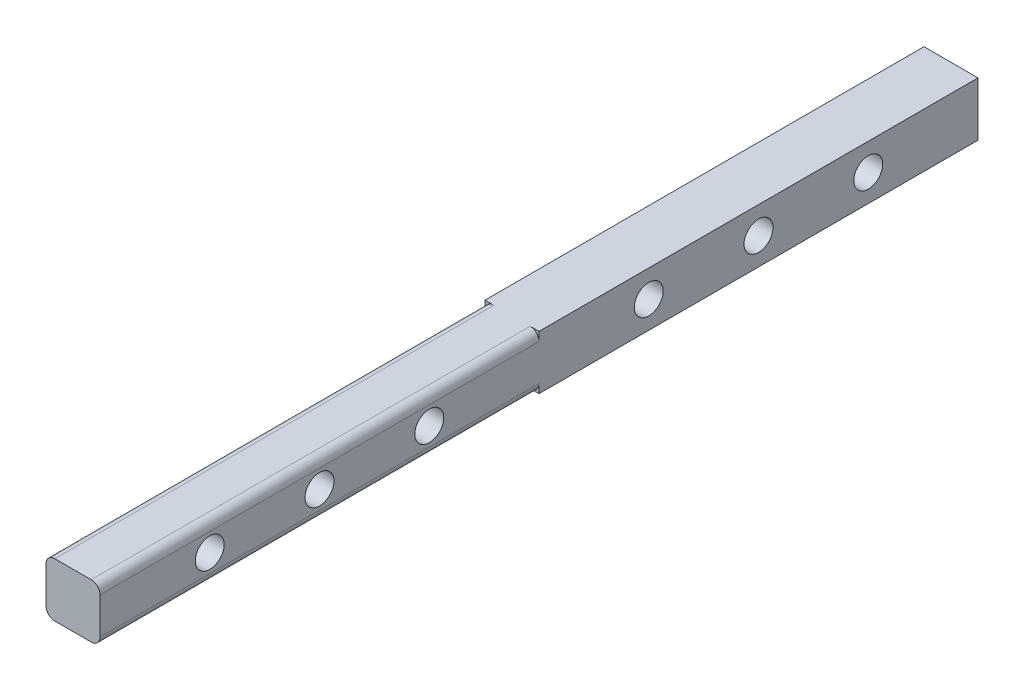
ISO-10303-21;
HEADER;
FILE_DESCRIPTION(('STEP AP214'),'2;1');
FILE_NAME('part.step','',(''),(''),'','','');
FILE_SCHEMA(('AUTOMOTIVE_DESIGN { 1 0 10303 214 1 1 1 1 }'));
ENDSEC;
DATA;
#1=APPLICATION_CONTEXT('core data for automotive mechanical design processes');
#2=APPLICATION_PROTOCOL_DEFINITION('international standard','automotive_design',2000,#1);
#3=PRODUCT_CONTEXT('',#1,'mechanical');
#4=PRODUCT('Part','Part','',(#3));
#5=PRODUCT_RELATED_PRODUCT_CATEGORY('part','',(#4));
#6=PRODUCT_DEFINITION_FORMATION('','',#4);
#7=PRODUCT_DEFINITION_CONTEXT('part definition',#1,'design');
#8=PRODUCT_DEFINITION('design','',#6,#7);
#9=PRODUCT_DEFINITION_SHAPE('','',#8);
#10=(LENGTH_UNIT() NAMED_UNIT(*) SI_UNIT(.MILLI.,.METRE.));
#11=(NAMED_UNIT(*) PLANE_ANGLE_UNIT() SI_UNIT($,.RADIAN.));
#12=(NAMED_UNIT(*) SI_UNIT($,.STERADIAN.) SOLID_ANGLE_UNIT());
#13=UNCERTAINTY_MEASURE_WITH_UNIT(LENGTH_MEASURE(1.E-05),#10,'distance_accuracy_value','');
#14=(GEOMETRIC_REPRESENTATION_CONTEXT(3) GLOBAL_UNCERTAINTY_ASSIGNED_CONTEXT((#13)) GLOBAL_UNIT_ASSIGNED_CONTEXT((#10,
#11,#12)) REPRESENTATION_CONTEXT('',''));
#15=CARTESIAN_POINT('',(0.,0.,0.));
#16=DIRECTION('',(0.,0.,1.));
#17=DIRECTION('',(1.,0.,0.));
#18=AXIS2_PLACEMENT_3D('',#15,#16,#17);
#19=CARTESIAN_POINT('',(3.075,3.075,50.));
#20=DIRECTION('',(-1.,0.,0.));
#21=DIRECTION('',(0.,0.,1.));
#22=AXIS2_PLACEMENT_3D('',#19,#20,#21);
#23=PLANE('',#22);
#24=CARTESIAN_POINT('',(3.075,0.,37.5));
#25=DIRECTION('',(1.,0.,0.));
#26=DIRECTION('',(0.,0.,-1.));
#27=AXIS2_PLACEMENT_3D('',#24,#25,#26);
#28=CIRCLE('',#27,1.65);
#29=CARTESIAN_POINT('',(3.075,0.,35.85));
#30=VERTEX_POINT('',#29);
#31=EDGE_CURVE('E229',#30,#30,#28,.T.);
#32=ORIENTED_EDGE('',*,*,#31,.F.);
#33=EDGE_LOOP('',(#32));
#34=FACE_BOUND('',#33,.T.);
#35=CARTESIAN_POINT('',(3.075,0.,25.));
#36=DIRECTION('',(1.,0.,0.));
#37=DIRECTION('',(0.,0.,-1.));
#38=AXIS2_PLACEMENT_3D('',#35,#36,#37);
#39=CIRCLE('',#38,1.65);
#40=CARTESIAN_POINT('',(3.075,0.,23.35));
#41=VERTEX_POINT('',#40);
#42=EDGE_CURVE('E239',#41,#41,#39,.T.);
#43=ORIENTED_EDGE('',*,*,#42,.F.);
#44=EDGE_LOOP('',(#43));
#45=FACE_BOUND('',#44,.T.);
#46=CARTESIAN_POINT('',(3.075,0.,12.5));
#47=DIRECTION('',(1.,0.,0.));
#48=DIRECTION('',(0.,0.,-1.));
#49=AXIS2_PLACEMENT_3D('',#46,#47,#48);
#50=CIRCLE('',#49,1.65);
#51=CARTESIAN_POINT('',(3.075,0.,10.85));
#52=VERTEX_POINT('',#51);
#53=EDGE_CURVE('E245',#52,#52,#50,.T.);
#54=ORIENTED_EDGE('',*,*,#53,.F.);
#55=EDGE_LOOP('',(#54));
#56=FACE_BOUND('',#55,.T.);
#57=CARTESIAN_POINT('',(3.075,0.,-12.5));
#58=DIRECTION('',(1.,0.,0.));
#59=DIRECTION('',(0.,0.,-1.));
#60=AXIS2_PLACEMENT_3D('',#57,#58,#59);
#61=CIRCLE('',#60,1.65);
#62=CARTESIAN_POINT('',(3.075,0.,-14.15));
#63=VERTEX_POINT('',#62);
#64=EDGE_CURVE('E251',#63,#63,#61,.T.);
#65=ORIENTED_EDGE('',*,*,#64,.F.);
#66=EDGE_LOOP('',(#65));
#67=FACE_BOUND('',#66,.T.);
#68=CARTESIAN_POINT('',(3.075,0.,-25.));
#69=DIRECTION('',(1.,0.,0.));
#70=DIRECTION('',(0.,0.,-1.));
#71=AXIS2_PLACEMENT_3D('',#68,#69,#70);
#72=CIRCLE('',#71,1.65);
#73=CARTESIAN_POINT('',(3.075,0.,-26.65));
#74=VERTEX_POINT('',#73);
#75=EDGE_CURVE('E257',#74,#74,#72,.T.);
#76=ORIENTED_EDGE('',*,*,#75,.F.);
#77=EDGE_LOOP('',(#76));
#78=FACE_BOUND('',#77,.T.);
#79=CARTESIAN_POINT('',(3.075,0.,-37.5));
#80=DIRECTION('',(1.,0.,0.));
#81=DIRECTION('',(0.,0.,-1.));
#82=AXIS2_PLACEMENT_3D('',#79,#80,#81);
#83=CIRCLE('',#82,1.65);
#84=CARTESIAN_POINT('',(3.075,0.,-39.15));
#85=VERTEX_POINT('',#84);
#86=EDGE_CURVE('E159',#85,#85,#83,.T.);
#87=ORIENTED_EDGE('',*,*,#86,.F.);
#88=EDGE_LOOP('',(#87));
#89=FACE_BOUND('',#88,.T.);
#90=DIRECTION('',(0.,1.,0.));
#91=VECTOR('',#90,1.);
#92=CARTESIAN_POINT('',(3.075,3.075,50.));
#93=LINE('',#92,#91);
#94=CARTESIAN_POINT('',(3.075,-2.075,50.));
#95=VERTEX_POINT('',#94);
#96=CARTESIAN_POINT('',(3.075,2.075,50.));
#97=VERTEX_POINT('',#96);
#98=EDGE_CURVE('E175',#95,#97,#93,.T.);
#99=ORIENTED_EDGE('',*,*,#98,.F.);
#100=DIRECTION('',(0.,0.,-1.));
#101=VECTOR('',#100,1.);
#102=CARTESIAN_POINT('',(3.075,-2.075,50.));
#103=LINE('',#102,#101);
#104=CARTESIAN_POINT('',(3.075,-2.075,0.));
#105=VERTEX_POINT('',#104);
#106=EDGE_CURVE('E191',#95,#105,#103,.T.);
#107=ORIENTED_EDGE('',*,*,#106,.T.);
#108=DIRECTION('',(0.,1.,0.));
#109=VECTOR('',#108,1.);
#110=CARTESIAN_POINT('',(3.075,3.075,0.));
#111=LINE('',#110,#109);
#112=CARTESIAN_POINT('',(3.075,-3.075,0.));
#113=VERTEX_POINT('',#112);
#114=EDGE_CURVE('E164',#113,#105,#111,.T.);
#115=ORIENTED_EDGE('',*,*,#114,.F.);
#116=DIRECTION('',(0.,0.,1.));
#117=VECTOR('',#116,1.);
#118=CARTESIAN_POINT('',(3.075,-3.075,-50.));
#119=LINE('',#118,#117);
#120=CARTESIAN_POINT('',(3.075,-3.075,-50.));
#121=VERTEX_POINT('',#120);
#122=EDGE_CURVE('E152',#121,#113,#119,.T.);
#123=ORIENTED_EDGE('',*,*,#122,.F.);
#124=DIRECTION('',(0.,1.,0.));
#125=VECTOR('',#124,1.);
#126=CARTESIAN_POINT('',(3.075,3.075,-50.));
#127=LINE('',#126,#125);
#128=CARTESIAN_POINT('',(3.075,3.075,-50.));
#129=VERTEX_POINT('',#128);
#130=EDGE_CURVE('E144',#121,#129,#127,.T.);
#131=ORIENTED_EDGE('',*,*,#130,.T.);
#132=DIRECTION('',(0.,0.,1.));
#133=VECTOR('',#132,1.);
#134=CARTESIAN_POINT('',(3.075,3.075,-50.));
#135=LINE('',#134,#133);
#136=CARTESIAN_POINT('',(3.075,3.075,0.));
#137=VERTEX_POINT('',#136);
#138=EDGE_CURVE('E125',#129,#137,#135,.T.);
#139=ORIENTED_EDGE('',*,*,#138,.T.);
#140=CARTESIAN_POINT('',(3.075,2.075,0.));
#141=VERTEX_POINT('',#140);
#142=EDGE_CURVE('E168',#141,#137,#111,.T.);
#143=ORIENTED_EDGE('',*,*,#142,.F.);
#144=DIRECTION('',(0.,0.,-1.));
#145=VECTOR('',#144,1.);
#146=CARTESIAN_POINT('',(3.075,2.075,50.));
#147=LINE('',#146,#145);
#148=EDGE_CURVE('E189',#141,#97,#147,.F.);
#149=ORIENTED_EDGE('',*,*,#148,.T.);
#150=EDGE_LOOP('',(#99,#107,#115,#123,#131,#139,#143,#149));
#151=FACE_BOUND('',#150,.T.);
#152=ADVANCED_FACE('F35',(#34,#45,#56,#67,#78,#89,#151),#23,.F.);
#153=CARTESIAN_POINT('',(-3.075,3.075,50.));
#154=DIRECTION('',(0.,-1.,0.));
#155=DIRECTION('',(0.,0.,-1.));
#156=AXIS2_PLACEMENT_3D('',#153,#154,#155);
#157=PLANE('',#156);
#158=DIRECTION('',(0.,0.,-1.));
#159=VECTOR('',#158,1.);
#160=CARTESIAN_POINT('',(2.075,3.075,50.));
#161=LINE('',#160,#159);
#162=CARTESIAN_POINT('',(2.075,3.075,50.));
#163=VERTEX_POINT('',#162);
#164=CARTESIAN_POINT('',(2.075,3.075,0.));
#165=VERTEX_POINT('',#164);
#166=EDGE_CURVE('E43',#163,#165,#161,.T.);
#167=ORIENTED_EDGE('',*,*,#166,.T.);
#168=DIRECTION('',(-1.,0.,0.));
#169=VECTOR('',#168,1.);
#170=CARTESIAN_POINT('',(-3.075,3.075,0.));
#171=LINE('',#170,#169);
#172=EDGE_CURVE('E132',#137,#165,#171,.T.);
#173=ORIENTED_EDGE('',*,*,#172,.F.);
#174=ORIENTED_EDGE('',*,*,#138,.F.);
#175=DIRECTION('',(-1.,0.,0.));
#176=VECTOR('',#175,1.);
#177=CARTESIAN_POINT('',(-3.075,3.075,-50.));
#178=LINE('',#177,#176);
#179=CARTESIAN_POINT('',(-3.075,3.075,-50.));
#180=VERTEX_POINT('',#179);
#181=EDGE_CURVE('E130',#129,#180,#178,.T.);
#182=ORIENTED_EDGE('',*,*,#181,.T.);
#183=DIRECTION('',(0.,0.,1.));
#184=VECTOR('',#183,1.);
#185=CARTESIAN_POINT('',(-3.075,3.075,-50.));
#186=LINE('',#185,#184);
#187=CARTESIAN_POINT('',(-3.075,3.075,0.));
#188=VERTEX_POINT('',#187);
#189=EDGE_CURVE('E136',#180,#188,#186,.T.);
#190=ORIENTED_EDGE('',*,*,#189,.T.);
#191=CARTESIAN_POINT('',(-2.075,3.075,0.));
#192=VERTEX_POINT('',#191);
#193=EDGE_CURVE('E167',#192,#188,#171,.T.);
#194=ORIENTED_EDGE('',*,*,#193,.F.);
#195=DIRECTION('',(0.,0.,-1.));
#196=VECTOR('',#195,1.);
#197=CARTESIAN_POINT('',(-2.075,3.075,50.));
#198=LINE('',#197,#196);
#199=CARTESIAN_POINT('',(-2.075,3.075,50.));
#200=VERTEX_POINT('',#199);
#201=EDGE_CURVE('E11',#192,#200,#198,.F.);
#202=ORIENTED_EDGE('',*,*,#201,.T.);
#203=DIRECTION('',(-1.,0.,0.));
#204=VECTOR('',#203,1.);
#205=CARTESIAN_POINT('',(-3.075,3.075,50.));
#206=LINE('',#205,#204);
#207=EDGE_CURVE('E182',#163,#200,#206,.T.);
#208=ORIENTED_EDGE('',*,*,#207,.F.);
#209=EDGE_LOOP('',(#167,#173,#174,#182,#190,#194,#202,#208));
#210=FACE_BOUND('',#209,.T.);
#211=ADVANCED_FACE('F128',(#210),#157,.F.);
#212=CARTESIAN_POINT('',(-3.075,3.075,50.));
#213=DIRECTION('',(1.,0.,0.));
#214=DIRECTION('',(0.,0.,-1.));
#215=AXIS2_PLACEMENT_3D('',#212,#213,#214);
#216=PLANE('',#215);
#217=CARTESIAN_POINT('',(-3.075,0.,37.5));
#218=DIRECTION('',(1.,0.,0.));
#219=DIRECTION('',(0.,0.,-1.));
#220=AXIS2_PLACEMENT_3D('',#217,#218,#219);
#221=CIRCLE('',#220,1.65);
#222=CARTESIAN_POINT('',(-3.075,0.,35.85));
#223=VERTEX_POINT('',#222);
#224=EDGE_CURVE('E227',#223,#223,#221,.T.);
#225=ORIENTED_EDGE('',*,*,#224,.T.);
#226=EDGE_LOOP('',(#225));
#227=FACE_BOUND('',#226,.T.);
#228=CARTESIAN_POINT('',(-3.075,0.,25.));
#229=DIRECTION('',(1.,0.,0.));
#230=DIRECTION('',(0.,0.,-1.));
#231=AXIS2_PLACEMENT_3D('',#228,#229,#230);
#232=CIRCLE('',#231,1.65);
#233=CARTESIAN_POINT('',(-3.075,0.,23.35));
#234=VERTEX_POINT('',#233);
#235=EDGE_CURVE('E234',#234,#234,#232,.T.);
#236=ORIENTED_EDGE('',*,*,#235,.T.);
#237=EDGE_LOOP('',(#236));
#238=FACE_BOUND('',#237,.T.);
#239=CARTESIAN_POINT('',(-3.075,0.,12.5));
#240=DIRECTION('',(1.,0.,0.));
#241=DIRECTION('',(0.,0.,-1.));
#242=AXIS2_PLACEMENT_3D('',#239,#240,#241);
#243=CIRCLE('',#242,1.65);
#244=CARTESIAN_POINT('',(-3.075,0.,10.85));
#245=VERTEX_POINT('',#244);
#246=EDGE_CURVE('E242',#245,#245,#243,.T.);
#247=ORIENTED_EDGE('',*,*,#246,.T.);
#248=EDGE_LOOP('',(#247));
#249=FACE_BOUND('',#248,.T.);
#250=CARTESIAN_POINT('',(-3.075,0.,-12.5));
#251=DIRECTION('',(1.,0.,0.));
#252=DIRECTION('',(0.,0.,-1.));
#253=AXIS2_PLACEMENT_3D('',#250,#251,#252);
#254=CIRCLE('',#253,1.65);
#255=CARTESIAN_POINT('',(-3.075,0.,-14.15));
#256=VERTEX_POINT('',#255);
#257=EDGE_CURVE('E248',#256,#256,#254,.T.);
#258=ORIENTED_EDGE('',*,*,#257,.T.);
#259=EDGE_LOOP('',(#258));
#260=FACE_BOUND('',#259,.T.);
#261=CARTESIAN_POINT('',(-3.075,0.,-25.));
#262=DIRECTION('',(1.,0.,0.));
#263=DIRECTION('',(0.,0.,-1.));
#264=AXIS2_PLACEMENT_3D('',#261,#262,#263);
#265=CIRCLE('',#264,1.65);
#266=CARTESIAN_POINT('',(-3.075,0.,-26.65));
#267=VERTEX_POINT('',#266);
#268=EDGE_CURVE('E254',#267,#267,#265,.T.);
#269=ORIENTED_EDGE('',*,*,#268,.T.);
#270=EDGE_LOOP('',(#269));
#271=FACE_BOUND('',#270,.T.);
#272=CARTESIAN_POINT('',(-3.075,0.,-37.5));
#273=DIRECTION('',(1.,0.,0.));
#274=DIRECTION('',(0.,0.,-1.));
#275=AXIS2_PLACEMENT_3D('',#272,#273,#274);
#276=CIRCLE('',#275,1.65);
#277=CARTESIAN_POINT('',(-3.075,0.,-39.15));
#278=VERTEX_POINT('',#277);
#279=EDGE_CURVE('E259',#278,#278,#276,.T.);
#280=ORIENTED_EDGE('',*,*,#279,.T.);
#281=EDGE_LOOP('',(#280));
#282=FACE_BOUND('',#281,.T.);
#283=DIRECTION('',(0.,0.,-1.));
#284=VECTOR('',#283,1.);
#285=CARTESIAN_POINT('',(-3.075,2.075,50.));
#286=LINE('',#285,#284);
#287=CARTESIAN_POINT('',(-3.075,2.075,50.));
#288=VERTEX_POINT('',#287);
#289=CARTESIAN_POINT('',(-3.075,2.075,0.));
#290=VERTEX_POINT('',#289);
#291=EDGE_CURVE('E218',#288,#290,#286,.T.);
#292=ORIENTED_EDGE('',*,*,#291,.T.);
#293=DIRECTION('',(0.,-1.,0.));
#294=VECTOR('',#293,1.);
#295=CARTESIAN_POINT('',(-3.075,3.075,0.));
#296=LINE('',#295,#294);
#297=EDGE_CURVE('E171',#188,#290,#296,.T.);
#298=ORIENTED_EDGE('',*,*,#297,.F.);
#299=ORIENTED_EDGE('',*,*,#189,.F.);
#300=DIRECTION('',(0.,-1.,0.));
#301=VECTOR('',#300,1.);
#302=CARTESIAN_POINT('',(-3.075,3.075,-50.));
#303=LINE('',#302,#301);
#304=CARTESIAN_POINT('',(-3.075,-3.075,-50.));
#305=VERTEX_POINT('',#304);
#306=EDGE_CURVE('E147',#180,#305,#303,.T.);
#307=ORIENTED_EDGE('',*,*,#306,.T.);
#308=DIRECTION('',(0.,0.,1.));
#309=VECTOR('',#308,1.);
#310=CARTESIAN_POINT('',(-3.075,-3.075,-50.));
#311=LINE('',#310,#309);
#312=CARTESIAN_POINT('',(-3.075,-3.075,0.));
#313=VERTEX_POINT('',#312);
#314=EDGE_CURVE('E176',#305,#313,#311,.T.);
#315=ORIENTED_EDGE('',*,*,#314,.T.);
#316=CARTESIAN_POINT('',(-3.075,-2.075,0.));
#317=VERTEX_POINT('',#316);
#318=EDGE_CURVE('E170',#317,#313,#296,.T.);
#319=ORIENTED_EDGE('',*,*,#318,.F.);
#320=DIRECTION('',(0.,0.,-1.));
#321=VECTOR('',#320,1.);
#322=CARTESIAN_POINT('',(-3.075,-2.075,50.));
#323=LINE('',#322,#321);
#324=CARTESIAN_POINT('',(-3.075,-2.075,50.));
#325=VERTEX_POINT('',#324);
#326=EDGE_CURVE('E50',#317,#325,#323,.F.);
#327=ORIENTED_EDGE('',*,*,#326,.T.);
#328=DIRECTION('',(0.,-1.,0.));
#329=VECTOR('',#328,1.);
#330=CARTESIAN_POINT('',(-3.075,3.075,50.));
#331=LINE('',#330,#329);
#332=EDGE_CURVE('E184',#288,#325,#331,.T.);
#333=ORIENTED_EDGE('',*,*,#332,.F.);
#334=EDGE_LOOP('',(#292,#298,#299,#307,#315,#319,#327,#333));
#335=FACE_BOUND('',#334,.T.);
#336=ADVANCED_FACE('F274',(#227,#238,#249,#260,#271,#282,#335),#216,.F.);
#337=CARTESIAN_POINT('',(-3.075,-3.075,50.));
#338=DIRECTION('',(0.,1.,0.));
#339=DIRECTION('',(0.,0.,1.));
#340=AXIS2_PLACEMENT_3D('',#337,#338,#339);
#341=PLANE('',#340);
#342=DIRECTION('',(0.,0.,-1.));
#343=VECTOR('',#342,1.);
#344=CARTESIAN_POINT('',(-2.075,-3.075,50.));
#345=LINE('',#344,#343);
#346=CARTESIAN_POINT('',(-2.075,-3.075,50.));
#347=VERTEX_POINT('',#346);
#348=CARTESIAN_POINT('',(-2.075,-3.075,0.));
#349=VERTEX_POINT('',#348);
#350=EDGE_CURVE('E206',#347,#349,#345,.T.);
#351=ORIENTED_EDGE('',*,*,#350,.T.);
#352=DIRECTION('',(1.,0.,0.));
#353=VECTOR('',#352,1.);
#354=CARTESIAN_POINT('',(-3.075,-3.075,0.));
#355=LINE('',#354,#353);
#356=EDGE_CURVE('E153',#313,#349,#355,.T.);
#357=ORIENTED_EDGE('',*,*,#356,.F.);
#358=ORIENTED_EDGE('',*,*,#314,.F.);
#359=DIRECTION('',(1.,0.,0.));
#360=VECTOR('',#359,1.);
#361=CARTESIAN_POINT('',(-3.075,-3.075,-50.));
#362=LINE('',#361,#360);
#363=EDGE_CURVE('E137',#305,#121,#362,.T.);
#364=ORIENTED_EDGE('',*,*,#363,.T.);
#365=ORIENTED_EDGE('',*,*,#122,.T.);
#366=CARTESIAN_POINT('',(2.075,-3.075,0.));
#367=VERTEX_POINT('',#366);
#368=EDGE_CURVE('E156',#367,#113,#355,.T.);
#369=ORIENTED_EDGE('',*,*,#368,.F.);
#370=DIRECTION('',(0.,0.,-1.));
#371=VECTOR('',#370,1.);
#372=CARTESIAN_POINT('',(2.075,-3.075,50.));
#373=LINE('',#372,#371);
#374=CARTESIAN_POINT('',(2.075,-3.075,50.));
#375=VERTEX_POINT('',#374);
#376=EDGE_CURVE('E209',#367,#375,#373,.F.);
#377=ORIENTED_EDGE('',*,*,#376,.T.);
#378=DIRECTION('',(1.,0.,0.));
#379=VECTOR('',#378,1.);
#380=CARTESIAN_POINT('',(-3.075,-3.075,50.));
#381=LINE('',#380,#379);
#382=EDGE_CURVE('E186',#347,#375,#381,.T.);
#383=ORIENTED_EDGE('',*,*,#382,.F.);
#384=EDGE_LOOP('',(#351,#357,#358,#364,#365,#369,#377,#383));
#385=FACE_BOUND('',#384,.T.);
#386=ADVANCED_FACE('F302',(#385),#341,.F.);
#387=CARTESIAN_POINT('',(0.,0.,50.));
#388=DIRECTION('',(0.,0.,1.));
#389=DIRECTION('',(1.,0.,0.));
#390=AXIS2_PLACEMENT_3D('',#387,#388,#389);
#391=PLANE('',#390);
#392=ORIENTED_EDGE('',*,*,#382,.T.);
#393=CARTESIAN_POINT('',(2.075,-2.075,50.));
#394=DIRECTION('',(0.,0.,1.));
#395=DIRECTION('',(1.,0.,0.));
#396=AXIS2_PLACEMENT_3D('',#393,#394,#395);
#397=CIRCLE('',#396,1.);
#398=EDGE_CURVE('E216',#375,#95,#397,.T.);
#399=ORIENTED_EDGE('',*,*,#398,.T.);
#400=ORIENTED_EDGE('',*,*,#98,.T.);
#401=CARTESIAN_POINT('',(2.075,2.075,50.));
#402=DIRECTION('',(0.,0.,1.));
#403=DIRECTION('',(1.,0.,0.));
#404=AXIS2_PLACEMENT_3D('',#401,#402,#403);
#405=CIRCLE('',#404,1.);
#406=EDGE_CURVE('E211',#97,#163,#405,.T.);
#407=ORIENTED_EDGE('',*,*,#406,.T.);
#408=ORIENTED_EDGE('',*,*,#207,.T.);
#409=CARTESIAN_POINT('',(-2.075,2.075,50.));
#410=DIRECTION('',(0.,0.,1.));
#411=DIRECTION('',(1.,0.,0.));
#412=AXIS2_PLACEMENT_3D('',#409,#410,#411);
#413=CIRCLE('',#412,1.);
#414=EDGE_CURVE('E57',#200,#288,#413,.T.);
#415=ORIENTED_EDGE('',*,*,#414,.T.);
#416=ORIENTED_EDGE('',*,*,#332,.T.);
#417=CARTESIAN_POINT('',(-2.075,-2.075,50.));
#418=DIRECTION('',(0.,0.,1.));
#419=DIRECTION('',(1.,0.,0.));
#420=AXIS2_PLACEMENT_3D('',#417,#418,#419);
#421=CIRCLE('',#420,1.);
#422=EDGE_CURVE('E214',#325,#347,#421,.T.);
#423=ORIENTED_EDGE('',*,*,#422,.T.);
#424=EDGE_LOOP('',(#392,#399,#400,#407,#408,#415,#416,#423));
#425=FACE_BOUND('',#424,.T.);
#426=ADVANCED_FACE('F284',(#425),#391,.T.);
#427=CARTESIAN_POINT('',(2.075,-2.075,50.));
#428=DIRECTION('',(0.,0.,-1.));
#429=DIRECTION('',(-1.,0.,0.));
#430=AXIS2_PLACEMENT_3D('',#427,#428,#429);
#431=CYLINDRICAL_SURFACE('',#430,1.);
#432=ORIENTED_EDGE('',*,*,#398,.F.);
#433=ORIENTED_EDGE('',*,*,#376,.F.);
#434=CARTESIAN_POINT('',(2.075,-2.075,0.));
#435=DIRECTION('',(0.,0.,1.));
#436=DIRECTION('',(1.,0.,0.));
#437=AXIS2_PLACEMENT_3D('',#434,#435,#436);
#438=CIRCLE('',#437,1.);
#439=EDGE_CURVE('E203',#105,#367,#438,.F.);
#440=ORIENTED_EDGE('',*,*,#439,.F.);
#441=ORIENTED_EDGE('',*,*,#106,.F.);
#442=EDGE_LOOP('',(#432,#433,#440,#441));
#443=FACE_BOUND('',#442,.T.);
#444=ADVANCED_FACE('F280',(#443),#431,.T.);
#445=CARTESIAN_POINT('',(-2.075,-2.075,50.));
#446=DIRECTION('',(0.,0.,-1.));
#447=DIRECTION('',(-1.,0.,0.));
#448=AXIS2_PLACEMENT_3D('',#445,#446,#447);
#449=CYLINDRICAL_SURFACE('',#448,1.);
#450=ORIENTED_EDGE('',*,*,#422,.F.);
#451=ORIENTED_EDGE('',*,*,#326,.F.);
#452=CARTESIAN_POINT('',(-2.075,-2.075,0.));
#453=DIRECTION('',(0.,0.,1.));
#454=DIRECTION('',(1.,0.,0.));
#455=AXIS2_PLACEMENT_3D('',#452,#453,#454);
#456=CIRCLE('',#455,1.);
#457=EDGE_CURVE('E200',#349,#317,#456,.F.);
#458=ORIENTED_EDGE('',*,*,#457,.F.);
#459=ORIENTED_EDGE('',*,*,#350,.F.);
#460=EDGE_LOOP('',(#450,#451,#458,#459));
#461=FACE_BOUND('',#460,.T.);
#462=ADVANCED_FACE('F283',(#461),#449,.T.);
#463=CARTESIAN_POINT('',(-2.075,2.075,50.));
#464=DIRECTION('',(0.,0.,-1.));
#465=DIRECTION('',(-1.,0.,0.));
#466=AXIS2_PLACEMENT_3D('',#463,#464,#465);
#467=CYLINDRICAL_SURFACE('',#466,1.);
#468=ORIENTED_EDGE('',*,*,#414,.F.);
#469=ORIENTED_EDGE('',*,*,#201,.F.);
#470=CARTESIAN_POINT('',(-2.075,2.075,0.));
#471=DIRECTION('',(0.,0.,1.));
#472=DIRECTION('',(1.,0.,0.));
#473=AXIS2_PLACEMENT_3D('',#470,#471,#472);
#474=CIRCLE('',#473,1.);
#475=EDGE_CURVE('E197',#290,#192,#474,.F.);
#476=ORIENTED_EDGE('',*,*,#475,.F.);
#477=ORIENTED_EDGE('',*,*,#291,.F.);
#478=EDGE_LOOP('',(#468,#469,#476,#477));
#479=FACE_BOUND('',#478,.T.);
#480=ADVANCED_FACE('F287',(#479),#467,.T.);
#481=CARTESIAN_POINT('',(2.075,2.075,50.));
#482=DIRECTION('',(0.,0.,-1.));
#483=DIRECTION('',(-1.,0.,0.));
#484=AXIS2_PLACEMENT_3D('',#481,#482,#483);
#485=CYLINDRICAL_SURFACE('',#484,1.);
#486=ORIENTED_EDGE('',*,*,#406,.F.);
#487=ORIENTED_EDGE('',*,*,#148,.F.);
#488=CARTESIAN_POINT('',(2.075,2.075,0.));
#489=DIRECTION('',(0.,0.,1.));
#490=DIRECTION('',(1.,0.,0.));
#491=AXIS2_PLACEMENT_3D('',#488,#489,#490);
#492=CIRCLE('',#491,1.);
#493=EDGE_CURVE('E194',#165,#141,#492,.F.);
#494=ORIENTED_EDGE('',*,*,#493,.F.);
#495=ORIENTED_EDGE('',*,*,#166,.F.);
#496=EDGE_LOOP('',(#486,#487,#494,#495));
#497=FACE_BOUND('',#496,.T.);
#498=ADVANCED_FACE('F37',(#497),#485,.T.);
#499=CARTESIAN_POINT('',(0.,0.,0.));
#500=DIRECTION('',(0.,0.,1.));
#501=DIRECTION('',(1.,0.,0.));
#502=AXIS2_PLACEMENT_3D('',#499,#500,#501);
#503=PLANE('',#502);
#504=ORIENTED_EDGE('',*,*,#114,.T.);
#505=ORIENTED_EDGE('',*,*,#439,.T.);
#506=ORIENTED_EDGE('',*,*,#368,.T.);
#507=EDGE_LOOP('',(#504,#505,#506));
#508=FACE_BOUND('',#507,.T.);
#509=ADVANCED_FACE('F294',(#508),#503,.T.);
#510=ORIENTED_EDGE('',*,*,#356,.T.);
#511=ORIENTED_EDGE('',*,*,#457,.T.);
#512=ORIENTED_EDGE('',*,*,#318,.T.);
#513=EDGE_LOOP('',(#510,#511,#512));
#514=FACE_BOUND('',#513,.T.);
#515=ADVANCED_FACE('F307',(#514),#503,.T.);
#516=ORIENTED_EDGE('',*,*,#297,.T.);
#517=ORIENTED_EDGE('',*,*,#475,.T.);
#518=ORIENTED_EDGE('',*,*,#193,.T.);
#519=EDGE_LOOP('',(#516,#517,#518));
#520=FACE_BOUND('',#519,.T.);
#521=ADVANCED_FACE('F298',(#520),#503,.T.);
#522=CARTESIAN_POINT('',(0.,0.,-50.));
#523=DIRECTION('',(0.,0.,1.));
#524=DIRECTION('',(1.,0.,0.));
#525=AXIS2_PLACEMENT_3D('',#522,#523,#524);
#526=PLANE('',#525);
#527=ORIENTED_EDGE('',*,*,#130,.F.);
#528=ORIENTED_EDGE('',*,*,#363,.F.);
#529=ORIENTED_EDGE('',*,*,#306,.F.);
#530=ORIENTED_EDGE('',*,*,#181,.F.);
#531=EDGE_LOOP('',(#527,#528,#529,#530));
#532=FACE_BOUND('',#531,.T.);
#533=ADVANCED_FACE('F142',(#532),#526,.F.);
#534=ORIENTED_EDGE('',*,*,#172,.T.);
#535=ORIENTED_EDGE('',*,*,#493,.T.);
#536=ORIENTED_EDGE('',*,*,#142,.T.);
#537=EDGE_LOOP('',(#534,#535,#536));
#538=FACE_BOUND('',#537,.T.);
#539=ADVANCED_FACE('F226',(#538),#503,.T.);
#540=CARTESIAN_POINT('',(-3.075,0.,-37.5));
#541=DIRECTION('',(1.,0.,0.));
#542=DIRECTION('',(0.,0.,-1.));
#543=AXIS2_PLACEMENT_3D('',#540,#541,#542);
#544=CYLINDRICAL_SURFACE('',#543,1.65);
#545=ORIENTED_EDGE('',*,*,#279,.F.);
#546=EDGE_LOOP('',(#545));
#547=FACE_BOUND('',#546,.T.);
#548=ORIENTED_EDGE('',*,*,#86,.T.);
#549=EDGE_LOOP('',(#548));
#550=FACE_BOUND('',#549,.T.);
#551=ADVANCED_FACE('F266',(#547,#550),#544,.F.);
#552=CARTESIAN_POINT('',(-3.075,0.,-25.));
#553=DIRECTION('',(1.,0.,0.));
#554=DIRECTION('',(0.,0.,-1.));
#555=AXIS2_PLACEMENT_3D('',#552,#553,#554);
#556=CYLINDRICAL_SURFACE('',#555,1.65);
#557=ORIENTED_EDGE('',*,*,#268,.F.);
#558=EDGE_LOOP('',(#557));
#559=FACE_BOUND('',#558,.T.);
#560=ORIENTED_EDGE('',*,*,#75,.T.);
#561=EDGE_LOOP('',(#560));
#562=FACE_BOUND('',#561,.T.);
#563=ADVANCED_FACE('F324',(#559,#562),#556,.F.);
#564=CARTESIAN_POINT('',(-3.075,0.,-12.5));
#565=DIRECTION('',(1.,0.,0.));
#566=DIRECTION('',(0.,0.,-1.));
#567=AXIS2_PLACEMENT_3D('',#564,#565,#566);
#568=CYLINDRICAL_SURFACE('',#567,1.65);
#569=ORIENTED_EDGE('',*,*,#257,.F.);
#570=EDGE_LOOP('',(#569));
#571=FACE_BOUND('',#570,.T.);
#572=ORIENTED_EDGE('',*,*,#64,.T.);
#573=EDGE_LOOP('',(#572));
#574=FACE_BOUND('',#573,.T.);
#575=ADVANCED_FACE('F372',(#571,#574),#568,.F.);
#576=CARTESIAN_POINT('',(-3.075,0.,12.5));
#577=DIRECTION('',(1.,0.,0.));
#578=DIRECTION('',(0.,0.,-1.));
#579=AXIS2_PLACEMENT_3D('',#576,#577,#578);
#580=CYLINDRICAL_SURFACE('',#579,1.65);
#581=ORIENTED_EDGE('',*,*,#246,.F.);
#582=EDGE_LOOP('',(#581));
#583=FACE_BOUND('',#582,.T.);
#584=ORIENTED_EDGE('',*,*,#53,.T.);
#585=EDGE_LOOP('',(#584));
#586=FACE_BOUND('',#585,.T.);
#587=ADVANCED_FACE('F382',(#583,#586),#580,.F.);
#588=CARTESIAN_POINT('',(-3.075,0.,25.));
#589=DIRECTION('',(1.,0.,0.));
#590=DIRECTION('',(0.,0.,-1.));
#591=AXIS2_PLACEMENT_3D('',#588,#589,#590);
#592=CYLINDRICAL_SURFACE('',#591,1.65);
#593=ORIENTED_EDGE('',*,*,#235,.F.);
#594=EDGE_LOOP('',(#593));
#595=FACE_BOUND('',#594,.T.);
#596=ORIENTED_EDGE('',*,*,#42,.T.);
#597=EDGE_LOOP('',(#596));
#598=FACE_BOUND('',#597,.T.);
#599=ADVANCED_FACE('F392',(#595,#598),#592,.F.);
#600=CARTESIAN_POINT('',(-3.075,0.,37.5));
#601=DIRECTION('',(1.,0.,0.));
#602=DIRECTION('',(0.,0.,-1.));
#603=AXIS2_PLACEMENT_3D('',#600,#601,#602);
#604=CYLINDRICAL_SURFACE('',#603,1.65);
#605=ORIENTED_EDGE('',*,*,#224,.F.);
#606=EDGE_LOOP('',(#605));
#607=FACE_BOUND('',#606,.T.);
#608=ORIENTED_EDGE('',*,*,#31,.T.);
#609=EDGE_LOOP('',(#608));
#610=FACE_BOUND('',#609,.T.);
#611=ADVANCED_FACE('F402',(#607,#610),#604,.F.);
#612=CLOSED_SHELL('',(#152,#211,#336,#386,#426,#444,#462,#480,#498,#509,#515,#521,#533,#539,
#551,#563,#575,#587,#599,#611));
#613=MANIFOLD_SOLID_BREP('B2',#612);
#614=ADVANCED_BREP_SHAPE_REPRESENTATION('',(#18,#613),#14);
#615=SHAPE_DEFINITION_REPRESENTATION(#9,#614);
ENDSEC;
END-ISO-10303-21;
